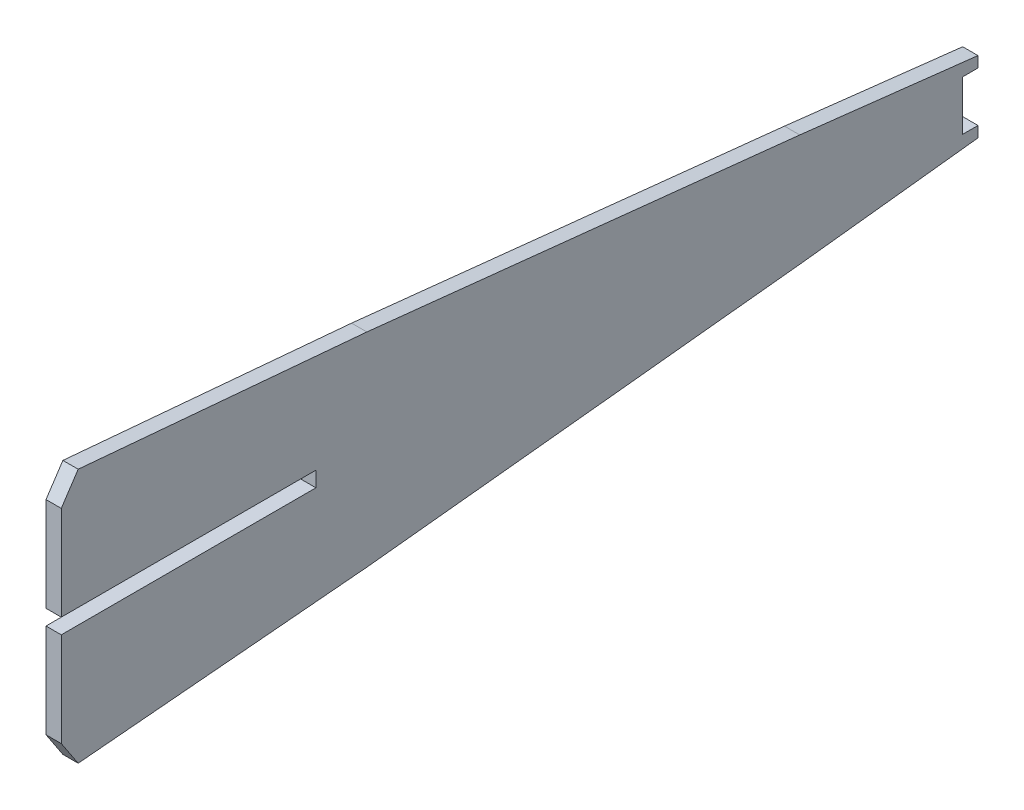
from build123d import *

# Parameters (mm, degrees)
SALIENTE_EXTRUIR1_DEPTH = 3
CROQUIS4_W              = 50
CROQUIS4_H              = 3
CORTAR_EXTRUIR1_DEPTH   = 10


with BuildPart() as part:
    # Croquis3 → Saliente-Extruir1 (new body)
    with BuildSketch(Plane(origin=(0, 0, 0), x_dir=(0, 0, -1), z_dir=(1, 0, 0))):
        Polygon((0, -20), (0, 20), (3.31662479, 25), (60, 20), (145, 11), (180, 7), (180, 4.885), (177, 4.885), (177, -4.885), (180, -4.885), (180, -7), (145, -11), (60, -20), (3.31662479, -25), align=None)
    extrude(amount=SALIENTE_EXTRUIR1_DEPTH)

    # Croquis4 → Cortar-Extruir1 (cut)
    with BuildSketch(Plane(origin=(3, 0, 0), x_dir=(0, 0, -1), z_dir=(1, 0, 0))):
        with Locations((25, 0)):
            Rectangle(CROQUIS4_W, CROQUIS4_H)
    extrude(amount=-CORTAR_EXTRUIR1_DEPTH, mode=Mode.SUBTRACT)


solid = part.part
